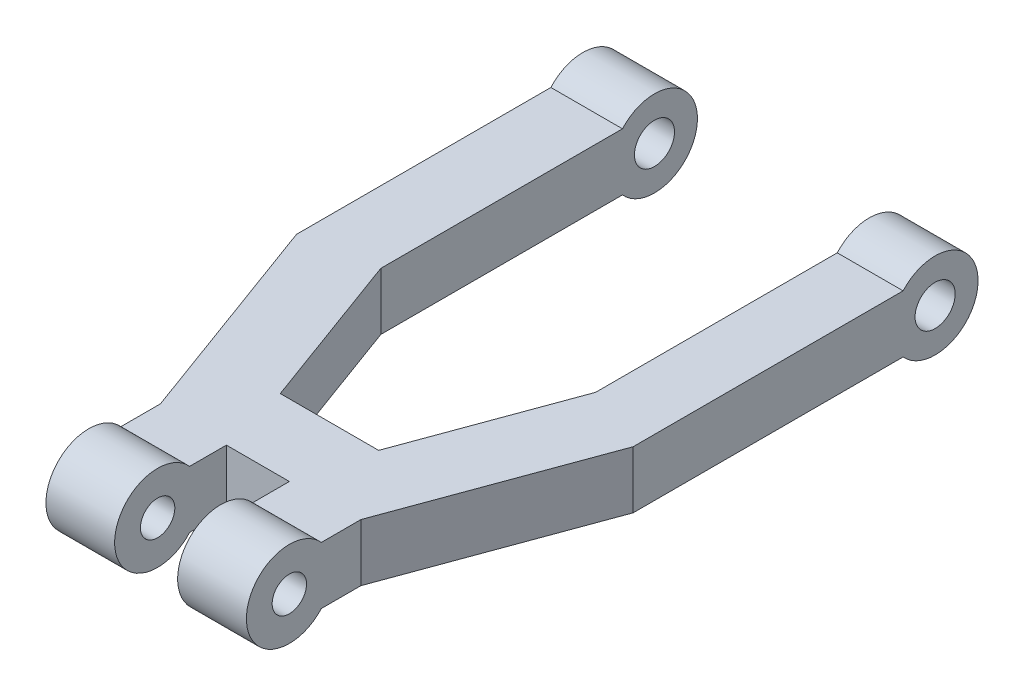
ISO-10303-21;
HEADER;
FILE_DESCRIPTION(('STEP AP214'),'2;1');
FILE_NAME('part.step','',(''),(''),'','','');
FILE_SCHEMA(('AUTOMOTIVE_DESIGN { 1 0 10303 214 1 1 1 1 }'));
ENDSEC;
DATA;
#1=APPLICATION_CONTEXT('core data for automotive mechanical design processes');
#2=APPLICATION_PROTOCOL_DEFINITION('international standard','automotive_design',2000,#1);
#3=PRODUCT_CONTEXT('',#1,'mechanical');
#4=PRODUCT('Part','Part','',(#3));
#5=PRODUCT_RELATED_PRODUCT_CATEGORY('part','',(#4));
#6=PRODUCT_DEFINITION_FORMATION('','',#4);
#7=PRODUCT_DEFINITION_CONTEXT('part definition',#1,'design');
#8=PRODUCT_DEFINITION('design','',#6,#7);
#9=PRODUCT_DEFINITION_SHAPE('','',#8);
#10=(LENGTH_UNIT() NAMED_UNIT(*) SI_UNIT(.MILLI.,.METRE.));
#11=(NAMED_UNIT(*) PLANE_ANGLE_UNIT() SI_UNIT($,.RADIAN.));
#12=(NAMED_UNIT(*) SI_UNIT($,.STERADIAN.) SOLID_ANGLE_UNIT());
#13=UNCERTAINTY_MEASURE_WITH_UNIT(LENGTH_MEASURE(1.E-05),#10,'distance_accuracy_value','');
#14=(GEOMETRIC_REPRESENTATION_CONTEXT(3) GLOBAL_UNCERTAINTY_ASSIGNED_CONTEXT((#13)) GLOBAL_UNIT_ASSIGNED_CONTEXT((#10,
#11,#12)) REPRESENTATION_CONTEXT('',''));
#15=CARTESIAN_POINT('',(0.,0.,0.));
#16=DIRECTION('',(0.,0.,1.));
#17=DIRECTION('',(1.,0.,0.));
#18=AXIS2_PLACEMENT_3D('',#15,#16,#17);
#19=CARTESIAN_POINT('',(0.,2.54,0.));
#20=DIRECTION('',(1.,0.,0.));
#21=DIRECTION('',(0.,0.,-1.));
#22=AXIS2_PLACEMENT_3D('',#19,#20,#21);
#23=CYLINDRICAL_SURFACE('',#22,3.81);
#24=CARTESIAN_POINT('',(13.081,2.54,0.));
#25=DIRECTION('',(-1.,0.,0.));
#26=DIRECTION('',(0.,0.,1.));
#27=AXIS2_PLACEMENT_3D('',#24,#25,#26);
#28=CIRCLE('',#27,3.81);
#29=CARTESIAN_POINT('',(13.081,5.08,-2.83980633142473));
#30=VERTEX_POINT('',#29);
#31=CARTESIAN_POINT('',(13.081,0.,-2.83980633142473));
#32=VERTEX_POINT('',#31);
#33=EDGE_CURVE('E272',#30,#32,#28,.F.);
#34=ORIENTED_EDGE('',*,*,#33,.F.);
#35=DIRECTION('',(1.,0.,0.));
#36=VECTOR('',#35,1.);
#37=CARTESIAN_POINT('',(0.,5.08,-2.83980633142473));
#38=LINE('',#37,#36);
#39=CARTESIAN_POINT('',(6.985,5.08,-2.83980633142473));
#40=VERTEX_POINT('',#39);
#41=EDGE_CURVE('E253',#40,#30,#38,.T.);
#42=ORIENTED_EDGE('',*,*,#41,.F.);
#43=CARTESIAN_POINT('',(6.985,2.54,0.));
#44=DIRECTION('',(1.,0.,0.));
#45=DIRECTION('',(0.,0.,-1.));
#46=AXIS2_PLACEMENT_3D('',#43,#44,#45);
#47=CIRCLE('',#46,3.81);
#48=CARTESIAN_POINT('',(6.985,0.,-2.83980633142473));
#49=VERTEX_POINT('',#48);
#50=EDGE_CURVE('E49',#49,#40,#47,.F.);
#51=ORIENTED_EDGE('',*,*,#50,.F.);
#52=DIRECTION('',(1.,0.,0.));
#53=VECTOR('',#52,1.);
#54=CARTESIAN_POINT('',(0.,0.,-2.83980633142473));
#55=LINE('',#54,#53);
#56=EDGE_CURVE('E254',#32,#49,#55,.F.);
#57=ORIENTED_EDGE('',*,*,#56,.F.);
#58=EDGE_LOOP('',(#34,#42,#51,#57));
#59=FACE_BOUND('',#58,.T.);
#60=ADVANCED_FACE('F32',(#59),#23,.T.);
#61=CARTESIAN_POINT('',(0.,2.54,-50.8));
#62=DIRECTION('',(1.,0.,0.));
#63=DIRECTION('',(0.,0.,-1.));
#64=AXIS2_PLACEMENT_3D('',#61,#62,#63);
#65=CYLINDRICAL_SURFACE('',#64,3.81);
#66=CARTESIAN_POINT('',(6.35,2.54,-50.8));
#67=DIRECTION('',(-1.,0.,0.));
#68=DIRECTION('',(0.,0.,1.));
#69=AXIS2_PLACEMENT_3D('',#66,#67,#68);
#70=CIRCLE('',#69,3.81);
#71=CARTESIAN_POINT('',(6.35,0.,-47.9601936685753));
#72=VERTEX_POINT('',#71);
#73=CARTESIAN_POINT('',(6.35,5.08,-47.9601936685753));
#74=VERTEX_POINT('',#73);
#75=EDGE_CURVE('E57',#72,#74,#70,.F.);
#76=ORIENTED_EDGE('',*,*,#75,.F.);
#77=DIRECTION('',(1.,0.,0.));
#78=VECTOR('',#77,1.);
#79=CARTESIAN_POINT('',(0.,0.,-47.9601936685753));
#80=LINE('',#79,#78);
#81=CARTESIAN_POINT('',(0.,0.,-47.9601936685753));
#82=VERTEX_POINT('',#81);
#83=EDGE_CURVE('E184',#82,#72,#80,.T.);
#84=ORIENTED_EDGE('',*,*,#83,.F.);
#85=CARTESIAN_POINT('',(0.,2.54,-50.8));
#86=DIRECTION('',(1.,0.,0.));
#87=DIRECTION('',(0.,0.,-1.));
#88=AXIS2_PLACEMENT_3D('',#85,#86,#87);
#89=CIRCLE('',#88,3.81);
#90=CARTESIAN_POINT('',(0.,5.08,-47.9601936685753));
#91=VERTEX_POINT('',#90);
#92=EDGE_CURVE('E240',#82,#91,#89,.T.);
#93=ORIENTED_EDGE('',*,*,#92,.T.);
#94=DIRECTION('',(1.,0.,0.));
#95=VECTOR('',#94,1.);
#96=CARTESIAN_POINT('',(0.,5.08,-47.9601936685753));
#97=LINE('',#96,#95);
#98=EDGE_CURVE('E243',#74,#91,#97,.F.);
#99=ORIENTED_EDGE('',*,*,#98,.F.);
#100=EDGE_LOOP('',(#76,#84,#93,#99));
#101=FACE_BOUND('',#100,.T.);
#102=ADVANCED_FACE('F371',(#101),#65,.T.);
#103=CARTESIAN_POINT('',(31.242,0.,0.));
#104=DIRECTION('',(0.,1.,0.));
#105=DIRECTION('',(0.,0.,1.));
#106=AXIS2_PLACEMENT_3D('',#103,#104,#105);
#107=PLANE('',#106);
#108=DIRECTION('',(-0.344254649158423,0.,0.938876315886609));
#109=VECTOR('',#108,1.);
#110=CARTESIAN_POINT('',(23.4801978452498,0.,-2.84599412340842));
#111=LINE('',#110,#109);
#112=CARTESIAN_POINT('',(31.242,0.,-24.0145454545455));
#113=VERTEX_POINT('',#112);
#114=CARTESIAN_POINT('',(24.765,0.,-6.35));
#115=VERTEX_POINT('',#114);
#116=EDGE_CURVE('E231',#113,#115,#111,.T.);
#117=ORIENTED_EDGE('',*,*,#116,.T.);
#118=DIRECTION('',(0.,0.,1.));
#119=VECTOR('',#118,1.);
#120=CARTESIAN_POINT('',(24.765,0.,0.));
#121=LINE('',#120,#119);
#122=CARTESIAN_POINT('',(24.765,0.,-2.83980633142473));
#123=VERTEX_POINT('',#122);
#124=EDGE_CURVE('E219',#115,#123,#121,.T.);
#125=ORIENTED_EDGE('',*,*,#124,.T.);
#126=CARTESIAN_POINT('',(18.669,0.,-2.83980633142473));
#127=VERTEX_POINT('',#126);
#128=EDGE_CURVE('E257',#123,#127,#55,.F.);
#129=ORIENTED_EDGE('',*,*,#128,.T.);
#130=DIRECTION('',(0.,0.,-1.));
#131=VECTOR('',#130,1.);
#132=CARTESIAN_POINT('',(18.669,0.,0.));
#133=LINE('',#132,#131);
#134=CARTESIAN_POINT('',(18.669,0.,-6.09943639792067));
#135=VERTEX_POINT('',#134);
#136=EDGE_CURVE('E210',#127,#135,#133,.T.);
#137=ORIENTED_EDGE('',*,*,#136,.T.);
#138=DIRECTION('',(-1.,0.,0.));
#139=VECTOR('',#138,1.);
#140=CARTESIAN_POINT('',(31.242,0.,-6.09943639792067));
#141=LINE('',#140,#139);
#142=CARTESIAN_POINT('',(13.081,0.,-6.09943639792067));
#143=VERTEX_POINT('',#142);
#144=EDGE_CURVE('E173',#135,#143,#141,.T.);
#145=ORIENTED_EDGE('',*,*,#144,.T.);
#146=DIRECTION('',(0.,0.,1.));
#147=VECTOR('',#146,1.);
#148=CARTESIAN_POINT('',(13.081,0.,0.));
#149=LINE('',#148,#147);
#150=EDGE_CURVE('E207',#143,#32,#149,.T.);
#151=ORIENTED_EDGE('',*,*,#150,.T.);
#152=ORIENTED_EDGE('',*,*,#56,.T.);
#153=DIRECTION('',(0.,0.,-1.));
#154=VECTOR('',#153,1.);
#155=CARTESIAN_POINT('',(6.985,0.,0.));
#156=LINE('',#155,#154);
#157=CARTESIAN_POINT('',(6.985,0.,-6.35));
#158=VERTEX_POINT('',#157);
#159=EDGE_CURVE('E198',#49,#158,#156,.T.);
#160=ORIENTED_EDGE('',*,*,#159,.T.);
#161=DIRECTION('',(-0.344254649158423,0.,-0.938876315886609));
#162=VECTOR('',#161,1.);
#163=CARTESIAN_POINT('',(11.9121273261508,0.,7.08761998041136));
#164=LINE('',#163,#162);
#165=CARTESIAN_POINT('',(0.,0.,-25.4));
#166=VERTEX_POINT('',#165);
#167=EDGE_CURVE('E225',#158,#166,#164,.T.);
#168=ORIENTED_EDGE('',*,*,#167,.T.);
#169=DIRECTION('',(0.,0.,-1.));
#170=VECTOR('',#169,1.);
#171=CARTESIAN_POINT('',(0.,0.,0.));
#172=LINE('',#171,#170);
#173=EDGE_CURVE('E264',#166,#82,#172,.T.);
#174=ORIENTED_EDGE('',*,*,#173,.T.);
#175=ORIENTED_EDGE('',*,*,#83,.T.);
#176=DIRECTION('',(0.,0.,1.));
#177=VECTOR('',#176,1.);
#178=CARTESIAN_POINT('',(6.35,0.,0.));
#179=LINE('',#178,#177);
#180=CARTESIAN_POINT('',(6.35,0.,-26.5274659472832));
#181=VERTEX_POINT('',#180);
#182=EDGE_CURVE('E177',#72,#181,#179,.T.);
#183=ORIENTED_EDGE('',*,*,#182,.T.);
#184=DIRECTION('',(0.344254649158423,0.,0.938876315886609));
#185=VECTOR('',#184,1.);
#186=CARTESIAN_POINT('',(17.8739919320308,0.,4.90160295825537));
#187=LINE('',#186,#185);
#188=CARTESIAN_POINT('',(11.5119441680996,0.,-12.4494363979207));
#189=VERTEX_POINT('',#188);
#190=EDGE_CURVE('E162',#181,#189,#187,.T.);
#191=ORIENTED_EDGE('',*,*,#190,.T.);
#192=DIRECTION('',(1.,0.,0.));
#193=VECTOR('',#192,1.);
#194=CARTESIAN_POINT('',(31.242,0.,-12.4494363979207));
#195=LINE('',#194,#193);
#196=CARTESIAN_POINT('',(20.2380558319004,0.,-12.4494363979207));
#197=VERTEX_POINT('',#196);
#198=EDGE_CURVE('E172',#189,#197,#195,.T.);
#199=ORIENTED_EDGE('',*,*,#198,.T.);
#200=DIRECTION('',(0.344254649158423,0.,-0.938876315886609));
#201=VECTOR('',#200,1.);
#202=CARTESIAN_POINT('',(17.5183332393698,0.,-5.0320111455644));
#203=LINE('',#202,#201);
#204=CARTESIAN_POINT('',(25.4,0.,-26.5274659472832));
#205=VERTEX_POINT('',#204);
#206=EDGE_CURVE('E236',#197,#205,#203,.T.);
#207=ORIENTED_EDGE('',*,*,#206,.T.);
#208=DIRECTION('',(0.,0.,-1.));
#209=VECTOR('',#208,1.);
#210=CARTESIAN_POINT('',(25.4,0.,0.));
#211=LINE('',#210,#209);
#212=CARTESIAN_POINT('',(25.4,0.,-47.9601936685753));
#213=VERTEX_POINT('',#212);
#214=EDGE_CURVE('E195',#205,#213,#211,.T.);
#215=ORIENTED_EDGE('',*,*,#214,.T.);
#216=CARTESIAN_POINT('',(31.242,0.,-47.9601936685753));
#217=VERTEX_POINT('',#216);
#218=EDGE_CURVE('E248',#213,#217,#80,.T.);
#219=ORIENTED_EDGE('',*,*,#218,.T.);
#220=DIRECTION('',(0.,0.,-1.));
#221=VECTOR('',#220,1.);
#222=CARTESIAN_POINT('',(31.242,0.,0.));
#223=LINE('',#222,#221);
#224=EDGE_CURVE('E258',#113,#217,#223,.T.);
#225=ORIENTED_EDGE('',*,*,#224,.F.);
#226=EDGE_LOOP('',(#117,#125,#129,#137,#145,#151,#152,#160,#168,#174,#175,#183,#191,#199,#207,
#215,#219,#225));
#227=FACE_BOUND('',#226,.T.);
#228=ADVANCED_FACE('F34',(#227),#107,.F.);
#229=CARTESIAN_POINT('',(31.242,5.08,0.));
#230=DIRECTION('',(0.,-1.,0.));
#231=DIRECTION('',(0.,0.,-1.));
#232=AXIS2_PLACEMENT_3D('',#229,#230,#231);
#233=PLANE('',#232);
#234=CARTESIAN_POINT('',(18.669,5.08,-2.83980633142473));
#235=VERTEX_POINT('',#234);
#236=CARTESIAN_POINT('',(24.765,5.08,-2.83980633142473));
#237=VERTEX_POINT('',#236);
#238=EDGE_CURVE('E250',#235,#237,#38,.T.);
#239=ORIENTED_EDGE('',*,*,#238,.T.);
#240=DIRECTION('',(0.,0.,-1.));
#241=VECTOR('',#240,1.);
#242=CARTESIAN_POINT('',(24.765,5.08,0.));
#243=LINE('',#242,#241);
#244=CARTESIAN_POINT('',(24.765,5.08,-6.35));
#245=VERTEX_POINT('',#244);
#246=EDGE_CURVE('E216',#237,#245,#243,.T.);
#247=ORIENTED_EDGE('',*,*,#246,.T.);
#248=DIRECTION('',(0.344254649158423,0.,-0.938876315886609));
#249=VECTOR('',#248,1.);
#250=CARTESIAN_POINT('',(23.4801978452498,5.08,-2.84599412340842));
#251=LINE('',#250,#249);
#252=CARTESIAN_POINT('',(31.242,5.08,-24.0145454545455));
#253=VERTEX_POINT('',#252);
#254=EDGE_CURVE('E228',#245,#253,#251,.T.);
#255=ORIENTED_EDGE('',*,*,#254,.T.);
#256=DIRECTION('',(0.,0.,1.));
#257=VECTOR('',#256,1.);
#258=CARTESIAN_POINT('',(31.242,5.08,0.));
#259=LINE('',#258,#257);
#260=CARTESIAN_POINT('',(31.242,5.08,-47.9601936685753));
#261=VERTEX_POINT('',#260);
#262=EDGE_CURVE('E260',#261,#253,#259,.T.);
#263=ORIENTED_EDGE('',*,*,#262,.F.);
#264=CARTESIAN_POINT('',(25.4,5.08,-47.9601936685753));
#265=VERTEX_POINT('',#264);
#266=EDGE_CURVE('E245',#261,#265,#97,.F.);
#267=ORIENTED_EDGE('',*,*,#266,.T.);
#268=DIRECTION('',(0.,0.,1.));
#269=VECTOR('',#268,1.);
#270=CARTESIAN_POINT('',(25.4,5.08,0.));
#271=LINE('',#270,#269);
#272=CARTESIAN_POINT('',(25.4,5.08,-26.5274659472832));
#273=VERTEX_POINT('',#272);
#274=EDGE_CURVE('E187',#265,#273,#271,.T.);
#275=ORIENTED_EDGE('',*,*,#274,.T.);
#276=DIRECTION('',(-0.344254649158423,0.,0.938876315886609));
#277=VECTOR('',#276,1.);
#278=CARTESIAN_POINT('',(17.5183332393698,5.08,-5.0320111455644));
#279=LINE('',#278,#277);
#280=CARTESIAN_POINT('',(20.2380558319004,5.08,-12.4494363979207));
#281=VERTEX_POINT('',#280);
#282=EDGE_CURVE('E11',#273,#281,#279,.T.);
#283=ORIENTED_EDGE('',*,*,#282,.T.);
#284=DIRECTION('',(-1.,0.,0.));
#285=VECTOR('',#284,1.);
#286=CARTESIAN_POINT('',(31.242,5.08,-12.4494363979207));
#287=LINE('',#286,#285);
#288=CARTESIAN_POINT('',(11.5119441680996,5.08,-12.4494363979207));
#289=VERTEX_POINT('',#288);
#290=EDGE_CURVE('E41',#281,#289,#287,.T.);
#291=ORIENTED_EDGE('',*,*,#290,.T.);
#292=DIRECTION('',(-0.344254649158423,0.,-0.938876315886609));
#293=VECTOR('',#292,1.);
#294=CARTESIAN_POINT('',(17.8739919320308,5.08,4.90160295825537));
#295=LINE('',#294,#293);
#296=CARTESIAN_POINT('',(6.35,5.08,-26.5274659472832));
#297=VERTEX_POINT('',#296);
#298=EDGE_CURVE('E286',#289,#297,#295,.T.);
#299=ORIENTED_EDGE('',*,*,#298,.T.);
#300=DIRECTION('',(0.,0.,-1.));
#301=VECTOR('',#300,1.);
#302=CARTESIAN_POINT('',(6.35,5.08,0.));
#303=LINE('',#302,#301);
#304=EDGE_CURVE('E180',#297,#74,#303,.T.);
#305=ORIENTED_EDGE('',*,*,#304,.T.);
#306=ORIENTED_EDGE('',*,*,#98,.T.);
#307=DIRECTION('',(0.,0.,1.));
#308=VECTOR('',#307,1.);
#309=CARTESIAN_POINT('',(0.,5.08,0.));
#310=LINE('',#309,#308);
#311=CARTESIAN_POINT('',(0.,5.08,-25.4));
#312=VERTEX_POINT('',#311);
#313=EDGE_CURVE('E261',#91,#312,#310,.T.);
#314=ORIENTED_EDGE('',*,*,#313,.T.);
#315=DIRECTION('',(0.344254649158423,0.,0.938876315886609));
#316=VECTOR('',#315,1.);
#317=CARTESIAN_POINT('',(11.9121273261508,5.08,7.08761998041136));
#318=LINE('',#317,#316);
#319=CARTESIAN_POINT('',(6.985,5.08,-6.35));
#320=VERTEX_POINT('',#319);
#321=EDGE_CURVE('E222',#312,#320,#318,.T.);
#322=ORIENTED_EDGE('',*,*,#321,.T.);
#323=DIRECTION('',(0.,0.,1.));
#324=VECTOR('',#323,1.);
#325=CARTESIAN_POINT('',(6.985,5.08,0.));
#326=LINE('',#325,#324);
#327=EDGE_CURVE('E201',#320,#40,#326,.T.);
#328=ORIENTED_EDGE('',*,*,#327,.T.);
#329=ORIENTED_EDGE('',*,*,#41,.T.);
#330=DIRECTION('',(0.,0.,-1.));
#331=VECTOR('',#330,1.);
#332=CARTESIAN_POINT('',(13.081,5.08,0.));
#333=LINE('',#332,#331);
#334=CARTESIAN_POINT('',(13.081,5.08,-6.09943639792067));
#335=VERTEX_POINT('',#334);
#336=EDGE_CURVE('E204',#30,#335,#333,.T.);
#337=ORIENTED_EDGE('',*,*,#336,.T.);
#338=DIRECTION('',(1.,0.,0.));
#339=VECTOR('',#338,1.);
#340=CARTESIAN_POINT('',(31.242,5.08,-6.09943639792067));
#341=LINE('',#340,#339);
#342=CARTESIAN_POINT('',(18.669,5.08,-6.09943639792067));
#343=VERTEX_POINT('',#342);
#344=EDGE_CURVE('E283',#335,#343,#341,.T.);
#345=ORIENTED_EDGE('',*,*,#344,.T.);
#346=DIRECTION('',(0.,0.,1.));
#347=VECTOR('',#346,1.);
#348=CARTESIAN_POINT('',(18.669,5.08,0.));
#349=LINE('',#348,#347);
#350=EDGE_CURVE('E213',#343,#235,#349,.T.);
#351=ORIENTED_EDGE('',*,*,#350,.T.);
#352=EDGE_LOOP('',(#239,#247,#255,#263,#267,#275,#283,#291,#299,#305,#306,#314,#322,#328,#329,
#337,#345,#351));
#353=FACE_BOUND('',#352,.T.);
#354=ADVANCED_FACE('F331',(#353),#233,.F.);
#355=CARTESIAN_POINT('',(31.242,0.,0.));
#356=DIRECTION('',(-1.,0.,0.));
#357=DIRECTION('',(0.,0.,1.));
#358=AXIS2_PLACEMENT_3D('',#355,#356,#357);
#359=PLANE('',#358);
#360=CARTESIAN_POINT('',(31.242,2.54,-50.8));
#361=DIRECTION('',(-1.,0.,0.));
#362=DIRECTION('',(0.,0.,1.));
#363=AXIS2_PLACEMENT_3D('',#360,#361,#362);
#364=CIRCLE('',#363,1.778);
#365=CARTESIAN_POINT('',(31.242,2.54,-49.022));
#366=VERTEX_POINT('',#365);
#367=EDGE_CURVE('E292',#366,#366,#364,.T.);
#368=ORIENTED_EDGE('',*,*,#367,.T.);
#369=EDGE_LOOP('',(#368));
#370=FACE_BOUND('',#369,.T.);
#371=ORIENTED_EDGE('',*,*,#262,.T.);
#372=DIRECTION('',(0.,-1.,0.));
#373=VECTOR('',#372,1.);
#374=CARTESIAN_POINT('',(31.242,0.,-24.0145454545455));
#375=LINE('',#374,#373);
#376=EDGE_CURVE('E280',#253,#113,#375,.T.);
#377=ORIENTED_EDGE('',*,*,#376,.T.);
#378=ORIENTED_EDGE('',*,*,#224,.T.);
#379=CARTESIAN_POINT('',(31.242,2.54,-50.8));
#380=DIRECTION('',(1.,0.,0.));
#381=DIRECTION('',(0.,0.,-1.));
#382=AXIS2_PLACEMENT_3D('',#379,#380,#381);
#383=CIRCLE('',#382,3.81);
#384=EDGE_CURVE('E239',#217,#261,#383,.T.);
#385=ORIENTED_EDGE('',*,*,#384,.T.);
#386=EDGE_LOOP('',(#371,#377,#378,#385));
#387=FACE_BOUND('',#386,.T.);
#388=ADVANCED_FACE('F347',(#370,#387),#359,.F.);
#389=CARTESIAN_POINT('',(0.,0.,0.));
#390=DIRECTION('',(-1.,0.,0.));
#391=DIRECTION('',(0.,0.,1.));
#392=AXIS2_PLACEMENT_3D('',#389,#390,#391);
#393=PLANE('',#392);
#394=CARTESIAN_POINT('',(0.,2.54,-50.8));
#395=DIRECTION('',(-1.,0.,0.));
#396=DIRECTION('',(0.,0.,1.));
#397=AXIS2_PLACEMENT_3D('',#394,#395,#396);
#398=CIRCLE('',#397,1.778);
#399=CARTESIAN_POINT('',(0.,2.54,-49.022));
#400=VERTEX_POINT('',#399);
#401=EDGE_CURVE('E299',#400,#400,#398,.T.);
#402=ORIENTED_EDGE('',*,*,#401,.F.);
#403=EDGE_LOOP('',(#402));
#404=FACE_BOUND('',#403,.T.);
#405=DIRECTION('',(0.,-1.,0.));
#406=VECTOR('',#405,1.);
#407=CARTESIAN_POINT('',(0.,0.,-25.4));
#408=LINE('',#407,#406);
#409=EDGE_CURVE('E278',#312,#166,#408,.T.);
#410=ORIENTED_EDGE('',*,*,#409,.F.);
#411=ORIENTED_EDGE('',*,*,#313,.F.);
#412=ORIENTED_EDGE('',*,*,#92,.F.);
#413=ORIENTED_EDGE('',*,*,#173,.F.);
#414=EDGE_LOOP('',(#410,#411,#412,#413));
#415=FACE_BOUND('',#414,.T.);
#416=ADVANCED_FACE('F379',(#404,#415),#393,.T.);
#417=CARTESIAN_POINT('',(24.765,2.54,0.));
#418=DIRECTION('',(-1.,0.,0.));
#419=DIRECTION('',(0.,0.,1.));
#420=AXIS2_PLACEMENT_3D('',#417,#418,#419);
#421=CIRCLE('',#420,3.81);
#422=EDGE_CURVE('E276',#237,#123,#421,.F.);
#423=ORIENTED_EDGE('',*,*,#422,.F.);
#424=ORIENTED_EDGE('',*,*,#238,.F.);
#425=CARTESIAN_POINT('',(18.669,2.54,0.));
#426=DIRECTION('',(1.,0.,0.));
#427=DIRECTION('',(0.,0.,-1.));
#428=AXIS2_PLACEMENT_3D('',#425,#426,#427);
#429=CIRCLE('',#428,3.81);
#430=EDGE_CURVE('E274',#127,#235,#429,.F.);
#431=ORIENTED_EDGE('',*,*,#430,.F.);
#432=ORIENTED_EDGE('',*,*,#128,.F.);
#433=EDGE_LOOP('',(#423,#424,#431,#432));
#434=FACE_BOUND('',#433,.T.);
#435=ADVANCED_FACE('F358',(#434),#23,.T.);
#436=CARTESIAN_POINT('',(25.4,2.54,-50.8));
#437=DIRECTION('',(1.,0.,0.));
#438=DIRECTION('',(0.,0.,-1.));
#439=AXIS2_PLACEMENT_3D('',#436,#437,#438);
#440=CIRCLE('',#439,3.81);
#441=EDGE_CURVE('E269',#265,#213,#440,.F.);
#442=ORIENTED_EDGE('',*,*,#441,.F.);
#443=ORIENTED_EDGE('',*,*,#266,.F.);
#444=ORIENTED_EDGE('',*,*,#384,.F.);
#445=ORIENTED_EDGE('',*,*,#218,.F.);
#446=EDGE_LOOP('',(#442,#443,#444,#445));
#447=FACE_BOUND('',#446,.T.);
#448=ADVANCED_FACE('F343',(#447),#65,.T.);
#449=CARTESIAN_POINT('',(25.4,-1.27,-26.5274659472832));
#450=DIRECTION('',(0.938876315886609,0.,0.344254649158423));
#451=DIRECTION('',(0.344254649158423,0.,-0.938876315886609));
#452=AXIS2_PLACEMENT_3D('',#449,#450,#451);
#453=PLANE('',#452);
#454=DIRECTION('',(0.,1.,0.));
#455=VECTOR('',#454,1.);
#456=CARTESIAN_POINT('',(20.2380558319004,-1.27,-12.4494363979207));
#457=LINE('',#456,#455);
#458=EDGE_CURVE('E324',#197,#281,#457,.T.);
#459=ORIENTED_EDGE('',*,*,#458,.T.);
#460=ORIENTED_EDGE('',*,*,#282,.F.);
#461=DIRECTION('',(0.,1.,0.));
#462=VECTOR('',#461,1.);
#463=CARTESIAN_POINT('',(25.4,-1.27,-26.5274659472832));
#464=LINE('',#463,#462);
#465=EDGE_CURVE('E190',#205,#273,#464,.T.);
#466=ORIENTED_EDGE('',*,*,#465,.F.);
#467=ORIENTED_EDGE('',*,*,#206,.F.);
#468=EDGE_LOOP('',(#459,#460,#466,#467));
#469=FACE_BOUND('',#468,.T.);
#470=ADVANCED_FACE('F335',(#469),#453,.F.);
#471=CARTESIAN_POINT('',(11.5119441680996,-1.27,-12.4494363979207));
#472=DIRECTION('',(0.,0.,1.));
#473=DIRECTION('',(1.,0.,0.));
#474=AXIS2_PLACEMENT_3D('',#471,#472,#473);
#475=PLANE('',#474);
#476=DIRECTION('',(0.,1.,0.));
#477=VECTOR('',#476,1.);
#478=CARTESIAN_POINT('',(11.5119441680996,-1.27,-12.4494363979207));
#479=LINE('',#478,#477);
#480=EDGE_CURVE('E168',#189,#289,#479,.T.);
#481=ORIENTED_EDGE('',*,*,#480,.T.);
#482=ORIENTED_EDGE('',*,*,#290,.F.);
#483=ORIENTED_EDGE('',*,*,#458,.F.);
#484=ORIENTED_EDGE('',*,*,#198,.F.);
#485=EDGE_LOOP('',(#481,#482,#483,#484));
#486=FACE_BOUND('',#485,.T.);
#487=ADVANCED_FACE('F328',(#486),#475,.F.);
#488=CARTESIAN_POINT('',(6.35,-1.27,-26.5274659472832));
#489=DIRECTION('',(-0.938876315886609,0.,0.344254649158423));
#490=DIRECTION('',(0.344254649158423,0.,0.938876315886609));
#491=AXIS2_PLACEMENT_3D('',#488,#489,#490);
#492=PLANE('',#491);
#493=DIRECTION('',(0.,1.,0.));
#494=VECTOR('',#493,1.);
#495=CARTESIAN_POINT('',(6.35,-1.27,-26.5274659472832));
#496=LINE('',#495,#494);
#497=EDGE_CURVE('E165',#181,#297,#496,.T.);
#498=ORIENTED_EDGE('',*,*,#497,.T.);
#499=ORIENTED_EDGE('',*,*,#298,.F.);
#500=ORIENTED_EDGE('',*,*,#480,.F.);
#501=ORIENTED_EDGE('',*,*,#190,.F.);
#502=EDGE_LOOP('',(#498,#499,#500,#501));
#503=FACE_BOUND('',#502,.T.);
#504=ADVANCED_FACE('F164',(#503),#492,.F.);
#505=CARTESIAN_POINT('',(25.4,-1.27,-57.9100704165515));
#506=DIRECTION('',(1.,0.,0.));
#507=DIRECTION('',(0.,0.,-1.));
#508=AXIS2_PLACEMENT_3D('',#505,#506,#507);
#509=PLANE('',#508);
#510=CARTESIAN_POINT('',(25.4,2.54,-50.8));
#511=DIRECTION('',(1.,0.,0.));
#512=DIRECTION('',(0.,0.,-1.));
#513=AXIS2_PLACEMENT_3D('',#510,#511,#512);
#514=CIRCLE('',#513,1.778);
#515=CARTESIAN_POINT('',(25.4,2.54,-49.022));
#516=VERTEX_POINT('',#515);
#517=EDGE_CURVE('E311',#516,#516,#514,.T.);
#518=ORIENTED_EDGE('',*,*,#517,.T.);
#519=EDGE_LOOP('',(#518));
#520=FACE_BOUND('',#519,.T.);
#521=ORIENTED_EDGE('',*,*,#465,.T.);
#522=ORIENTED_EDGE('',*,*,#274,.F.);
#523=ORIENTED_EDGE('',*,*,#441,.T.);
#524=ORIENTED_EDGE('',*,*,#214,.F.);
#525=EDGE_LOOP('',(#521,#522,#523,#524));
#526=FACE_BOUND('',#525,.T.);
#527=ADVANCED_FACE('F337',(#520,#526),#509,.F.);
#528=CARTESIAN_POINT('',(6.35,-1.27,-57.9100704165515));
#529=DIRECTION('',(-1.,0.,0.));
#530=DIRECTION('',(0.,0.,1.));
#531=AXIS2_PLACEMENT_3D('',#528,#529,#530);
#532=PLANE('',#531);
#533=CARTESIAN_POINT('',(6.35,2.54,-50.8));
#534=DIRECTION('',(-1.,0.,0.));
#535=DIRECTION('',(0.,0.,1.));
#536=AXIS2_PLACEMENT_3D('',#533,#534,#535);
#537=CIRCLE('',#536,1.778);
#538=CARTESIAN_POINT('',(6.35,2.54,-49.022));
#539=VERTEX_POINT('',#538);
#540=EDGE_CURVE('E36',#539,#539,#537,.T.);
#541=ORIENTED_EDGE('',*,*,#540,.T.);
#542=EDGE_LOOP('',(#541));
#543=FACE_BOUND('',#542,.T.);
#544=ORIENTED_EDGE('',*,*,#497,.F.);
#545=ORIENTED_EDGE('',*,*,#182,.F.);
#546=ORIENTED_EDGE('',*,*,#75,.T.);
#547=ORIENTED_EDGE('',*,*,#304,.F.);
#548=EDGE_LOOP('',(#544,#545,#546,#547));
#549=FACE_BOUND('',#548,.T.);
#550=ADVANCED_FACE('F176',(#543,#549),#532,.F.);
#551=CARTESIAN_POINT('',(0.,-1.27,-25.4));
#552=DIRECTION('',(0.938876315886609,0.,-0.344254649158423));
#553=DIRECTION('',(-0.344254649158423,0.,-0.938876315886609));
#554=AXIS2_PLACEMENT_3D('',#551,#552,#553);
#555=PLANE('',#554);
#556=DIRECTION('',(0.,1.,0.));
#557=VECTOR('',#556,1.);
#558=CARTESIAN_POINT('',(6.985,-1.27,-6.35));
#559=LINE('',#558,#557);
#560=EDGE_CURVE('E185',#158,#320,#559,.T.);
#561=ORIENTED_EDGE('',*,*,#560,.T.);
#562=ORIENTED_EDGE('',*,*,#321,.F.);
#563=ORIENTED_EDGE('',*,*,#409,.T.);
#564=ORIENTED_EDGE('',*,*,#167,.F.);
#565=EDGE_LOOP('',(#561,#562,#563,#564));
#566=FACE_BOUND('',#565,.T.);
#567=ADVANCED_FACE('F447',(#566),#555,.F.);
#568=CARTESIAN_POINT('',(6.985,-1.27,-6.35));
#569=DIRECTION('',(1.,0.,0.));
#570=DIRECTION('',(0.,0.,-1.));
#571=AXIS2_PLACEMENT_3D('',#568,#569,#570);
#572=PLANE('',#571);
#573=CARTESIAN_POINT('',(6.985,2.54,0.));
#574=DIRECTION('',(1.,0.,0.));
#575=DIRECTION('',(0.,0.,-1.));
#576=AXIS2_PLACEMENT_3D('',#573,#574,#575);
#577=CIRCLE('',#576,1.524);
#578=CARTESIAN_POINT('',(6.985,2.54,1.524));
#579=VERTEX_POINT('',#578);
#580=EDGE_CURVE('E308',#579,#579,#577,.T.);
#581=ORIENTED_EDGE('',*,*,#580,.T.);
#582=EDGE_LOOP('',(#581));
#583=FACE_BOUND('',#582,.T.);
#584=ORIENTED_EDGE('',*,*,#560,.F.);
#585=ORIENTED_EDGE('',*,*,#159,.F.);
#586=ORIENTED_EDGE('',*,*,#50,.T.);
#587=ORIENTED_EDGE('',*,*,#327,.F.);
#588=EDGE_LOOP('',(#584,#585,#586,#587));
#589=FACE_BOUND('',#588,.T.);
#590=ADVANCED_FACE('F456',(#583,#589),#572,.F.);
#591=CARTESIAN_POINT('',(13.081,-1.27,-6.09943639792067));
#592=DIRECTION('',(0.,0.,-1.));
#593=DIRECTION('',(-1.,0.,0.));
#594=AXIS2_PLACEMENT_3D('',#591,#592,#593);
#595=PLANE('',#594);
#596=DIRECTION('',(0.,1.,0.));
#597=VECTOR('',#596,1.);
#598=CARTESIAN_POINT('',(18.669,-1.27,-6.09943639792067));
#599=LINE('',#598,#597);
#600=EDGE_CURVE('E314',#135,#343,#599,.T.);
#601=ORIENTED_EDGE('',*,*,#600,.T.);
#602=ORIENTED_EDGE('',*,*,#344,.F.);
#603=DIRECTION('',(0.,1.,0.));
#604=VECTOR('',#603,1.);
#605=CARTESIAN_POINT('',(13.081,-1.27,-6.09943639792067));
#606=LINE('',#605,#604);
#607=EDGE_CURVE('E315',#143,#335,#606,.T.);
#608=ORIENTED_EDGE('',*,*,#607,.F.);
#609=ORIENTED_EDGE('',*,*,#144,.F.);
#610=EDGE_LOOP('',(#601,#602,#608,#609));
#611=FACE_BOUND('',#610,.T.);
#612=ADVANCED_FACE('F364',(#611),#595,.F.);
#613=CARTESIAN_POINT('',(18.669,-1.27,-6.09943639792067));
#614=DIRECTION('',(1.,0.,0.));
#615=DIRECTION('',(0.,0.,-1.));
#616=AXIS2_PLACEMENT_3D('',#613,#614,#615);
#617=PLANE('',#616);
#618=CARTESIAN_POINT('',(18.669,2.54,0.));
#619=DIRECTION('',(1.,0.,0.));
#620=DIRECTION('',(0.,0.,-1.));
#621=AXIS2_PLACEMENT_3D('',#618,#619,#620);
#622=CIRCLE('',#621,1.524);
#623=CARTESIAN_POINT('',(18.669,2.54,1.524));
#624=VERTEX_POINT('',#623);
#625=EDGE_CURVE('E296',#624,#624,#622,.T.);
#626=ORIENTED_EDGE('',*,*,#625,.T.);
#627=EDGE_LOOP('',(#626));
#628=FACE_BOUND('',#627,.T.);
#629=ORIENTED_EDGE('',*,*,#600,.F.);
#630=ORIENTED_EDGE('',*,*,#136,.F.);
#631=ORIENTED_EDGE('',*,*,#430,.T.);
#632=ORIENTED_EDGE('',*,*,#350,.F.);
#633=EDGE_LOOP('',(#629,#630,#631,#632));
#634=FACE_BOUND('',#633,.T.);
#635=ADVANCED_FACE('F362',(#628,#634),#617,.F.);
#636=CARTESIAN_POINT('',(13.081,-1.27,-6.09943639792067));
#637=DIRECTION('',(-1.,0.,0.));
#638=DIRECTION('',(0.,0.,1.));
#639=AXIS2_PLACEMENT_3D('',#636,#637,#638);
#640=PLANE('',#639);
#641=CARTESIAN_POINT('',(13.081,2.54,0.));
#642=DIRECTION('',(-1.,0.,0.));
#643=DIRECTION('',(0.,0.,1.));
#644=AXIS2_PLACEMENT_3D('',#641,#642,#643);
#645=CIRCLE('',#644,1.524);
#646=CARTESIAN_POINT('',(13.081,2.54,1.524));
#647=VERTEX_POINT('',#646);
#648=EDGE_CURVE('E291',#647,#647,#645,.T.);
#649=ORIENTED_EDGE('',*,*,#648,.T.);
#650=EDGE_LOOP('',(#649));
#651=FACE_BOUND('',#650,.T.);
#652=ORIENTED_EDGE('',*,*,#607,.T.);
#653=ORIENTED_EDGE('',*,*,#336,.F.);
#654=ORIENTED_EDGE('',*,*,#33,.T.);
#655=ORIENTED_EDGE('',*,*,#150,.F.);
#656=EDGE_LOOP('',(#652,#653,#654,#655));
#657=FACE_BOUND('',#656,.T.);
#658=ADVANCED_FACE('F369',(#651,#657),#640,.F.);
#659=CARTESIAN_POINT('',(31.75,-1.27,-25.4));
#660=DIRECTION('',(-0.938876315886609,0.,-0.344254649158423));
#661=DIRECTION('',(-0.344254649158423,0.,0.938876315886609));
#662=AXIS2_PLACEMENT_3D('',#659,#660,#661);
#663=PLANE('',#662);
#664=ORIENTED_EDGE('',*,*,#376,.F.);
#665=ORIENTED_EDGE('',*,*,#254,.F.);
#666=DIRECTION('',(0.,1.,0.));
#667=VECTOR('',#666,1.);
#668=CARTESIAN_POINT('',(24.765,-1.27,-6.35));
#669=LINE('',#668,#667);
#670=EDGE_CURVE('E181',#115,#245,#669,.T.);
#671=ORIENTED_EDGE('',*,*,#670,.F.);
#672=ORIENTED_EDGE('',*,*,#116,.F.);
#673=EDGE_LOOP('',(#664,#665,#671,#672));
#674=FACE_BOUND('',#673,.T.);
#675=ADVANCED_FACE('F352',(#674),#663,.F.);
#676=CARTESIAN_POINT('',(24.765,-1.27,-6.35));
#677=DIRECTION('',(-1.,0.,0.));
#678=DIRECTION('',(0.,0.,1.));
#679=AXIS2_PLACEMENT_3D('',#676,#677,#678);
#680=PLANE('',#679);
#681=CARTESIAN_POINT('',(24.765,2.54,0.));
#682=DIRECTION('',(-1.,0.,0.));
#683=DIRECTION('',(0.,0.,1.));
#684=AXIS2_PLACEMENT_3D('',#681,#682,#683);
#685=CIRCLE('',#684,1.524);
#686=CARTESIAN_POINT('',(24.765,2.54,1.524));
#687=VERTEX_POINT('',#686);
#688=EDGE_CURVE('E289',#687,#687,#685,.T.);
#689=ORIENTED_EDGE('',*,*,#688,.T.);
#690=EDGE_LOOP('',(#689));
#691=FACE_BOUND('',#690,.T.);
#692=ORIENTED_EDGE('',*,*,#670,.T.);
#693=ORIENTED_EDGE('',*,*,#246,.F.);
#694=ORIENTED_EDGE('',*,*,#422,.T.);
#695=ORIENTED_EDGE('',*,*,#124,.F.);
#696=EDGE_LOOP('',(#692,#693,#694,#695));
#697=FACE_BOUND('',#696,.T.);
#698=ADVANCED_FACE('F355',(#691,#697),#680,.F.);
#699=CARTESIAN_POINT('',(31.242,2.54,0.));
#700=DIRECTION('',(-1.,0.,0.));
#701=DIRECTION('',(0.,0.,1.));
#702=AXIS2_PLACEMENT_3D('',#699,#700,#701);
#703=CYLINDRICAL_SURFACE('',#702,1.524);
#704=CARTESIAN_POINT('',(24.765,2.54,1.524));
#705=CARTESIAN_POINT('',(24.7015,2.54,1.524));
#706=CARTESIAN_POINT('',(24.638,2.54,1.524));
#707=CARTESIAN_POINT('',(24.511,2.54,1.524));
#708=CARTESIAN_POINT('',(24.4475,2.54,1.524));
#709=CARTESIAN_POINT('',(24.3205,2.54,1.524));
#710=CARTESIAN_POINT('',(24.257,2.54,1.524));
#711=CARTESIAN_POINT('',(24.13,2.54,1.524));
#712=CARTESIAN_POINT('',(24.0665,2.54,1.524));
#713=CARTESIAN_POINT('',(23.9395,2.54,1.524));
#714=CARTESIAN_POINT('',(23.876,2.54,1.524));
#715=CARTESIAN_POINT('',(23.749,2.54,1.524));
#716=CARTESIAN_POINT('',(23.6855,2.54,1.524));
#717=CARTESIAN_POINT('',(23.5585,2.54,1.524));
#718=CARTESIAN_POINT('',(23.495,2.54,1.524));
#719=CARTESIAN_POINT('',(23.368,2.54,1.524));
#720=CARTESIAN_POINT('',(23.3045,2.54,1.524));
#721=CARTESIAN_POINT('',(23.1775,2.54,1.524));
#722=CARTESIAN_POINT('',(23.114,2.54,1.524));
#723=CARTESIAN_POINT('',(22.987,2.54,1.524));
#724=CARTESIAN_POINT('',(22.9235,2.54,1.524));
#725=CARTESIAN_POINT('',(22.7965,2.54,1.524));
#726=CARTESIAN_POINT('',(22.733,2.54,1.524));
#727=CARTESIAN_POINT('',(22.606,2.54,1.524));
#728=CARTESIAN_POINT('',(22.5425,2.54,1.524));
#729=CARTESIAN_POINT('',(22.4155,2.54,1.524));
#730=CARTESIAN_POINT('',(22.352,2.54,1.524));
#731=CARTESIAN_POINT('',(22.225,2.54,1.524));
#732=CARTESIAN_POINT('',(22.1615,2.54,1.524));
#733=CARTESIAN_POINT('',(22.0345,2.54,1.524));
#734=CARTESIAN_POINT('',(21.971,2.54,1.524));
#735=CARTESIAN_POINT('',(21.844,2.54,1.524));
#736=CARTESIAN_POINT('',(21.7805,2.54,1.524));
#737=CARTESIAN_POINT('',(21.6535,2.54,1.524));
#738=CARTESIAN_POINT('',(21.59,2.54,1.524));
#739=CARTESIAN_POINT('',(21.463,2.54,1.524));
#740=CARTESIAN_POINT('',(21.3995,2.54,1.524));
#741=CARTESIAN_POINT('',(21.2725,2.54,1.524));
#742=CARTESIAN_POINT('',(21.209,2.54,1.524));
#743=CARTESIAN_POINT('',(21.082,2.54,1.524));
#744=CARTESIAN_POINT('',(21.0185,2.54,1.524));
#745=CARTESIAN_POINT('',(20.8915,2.54,1.524));
#746=CARTESIAN_POINT('',(20.828,2.54,1.524));
#747=CARTESIAN_POINT('',(20.701,2.54,1.524));
#748=CARTESIAN_POINT('',(20.6375,2.54,1.524));
#749=CARTESIAN_POINT('',(20.5105,2.54,1.524));
#750=CARTESIAN_POINT('',(20.447,2.54,1.524));
#751=CARTESIAN_POINT('',(20.32,2.54,1.524));
#752=CARTESIAN_POINT('',(20.2565,2.54,1.524));
#753=CARTESIAN_POINT('',(20.1295,2.54,1.524));
#754=CARTESIAN_POINT('',(20.066,2.54,1.524));
#755=CARTESIAN_POINT('',(19.939,2.54,1.524));
#756=CARTESIAN_POINT('',(19.8755,2.54,1.524));
#757=CARTESIAN_POINT('',(19.7485,2.54,1.524));
#758=CARTESIAN_POINT('',(19.685,2.54,1.524));
#759=CARTESIAN_POINT('',(19.558,2.54,1.524));
#760=CARTESIAN_POINT('',(19.4945,2.54,1.524));
#761=CARTESIAN_POINT('',(19.3675,2.54,1.524));
#762=CARTESIAN_POINT('',(19.304,2.54,1.524));
#763=CARTESIAN_POINT('',(19.177,2.54,1.524));
#764=CARTESIAN_POINT('',(19.1135,2.54,1.524));
#765=CARTESIAN_POINT('',(18.9865,2.54,1.524));
#766=CARTESIAN_POINT('',(18.923,2.54,1.524));
#767=CARTESIAN_POINT('',(18.796,2.54,1.524));
#768=CARTESIAN_POINT('',(18.7325,2.54,1.524));
#769=CARTESIAN_POINT('',(18.669,2.54,1.524));
#770=B_SPLINE_CURVE_WITH_KNOTS('',3,(#704,#705,#706,#707,#708,#709,#710,#711,#712,#713,#714,
#715,#716,#717,#718,#719,#720,#721,#722,#723,#724,#725,#726,#727,#728,#729,#730,#731,#732,#733,
#734,#735,#736,#737,#738,#739,#740,#741,#742,#743,#744,#745,#746,#747,#748,#749,#750,#751,#752,
#753,#754,#755,#756,#757,#758,#759,#760,#761,#762,#763,#764,#765,#766,#767,#768,#769),
.UNSPECIFIED.,.F.,.F.,(4,2,2,2,2,2,2,2,2,2,2,2,2,2,2,2,2,2,2,2,2,2,2,2,2,2,2,2,2,2,2,2,4),(0.,
0.1905,0.380999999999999,0.571499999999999,0.761999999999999,0.952499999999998,1.143,1.3335,
1.524,1.7145,1.905,2.0955,2.286,2.4765,2.667,2.8575,3.048,3.23849999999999,3.429,
3.61949999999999,3.81,4.00049999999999,4.191,4.3815,4.572,4.7625,4.953,5.1435,5.334,5.5245,
5.71499999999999,5.9055,6.09599999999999),.UNSPECIFIED.);
#771=EDGE_CURVE('BSEAM503',#687,#624,#770,.T.);
#772=ORIENTED_EDGE('',*,*,#688,.F.);
#773=ORIENTED_EDGE('',*,*,#625,.F.);
#774=ORIENTED_EDGE('',*,*,#771,.T.);
#775=ORIENTED_EDGE('',*,*,#771,.F.);
#776=EDGE_LOOP('',(#772,#774,#773,#775));
#777=FACE_BOUND('',#776,.T.);
#778=ADVANCED_FACE('F503',(#777),#703,.F.);
#779=CARTESIAN_POINT('',(13.081,2.54,1.524));
#780=CARTESIAN_POINT('',(13.0175,2.54,1.524));
#781=CARTESIAN_POINT('',(12.954,2.54,1.524));
#782=CARTESIAN_POINT('',(12.827,2.54,1.524));
#783=CARTESIAN_POINT('',(12.7635,2.54,1.524));
#784=CARTESIAN_POINT('',(12.6365,2.54,1.524));
#785=CARTESIAN_POINT('',(12.573,2.54,1.524));
#786=CARTESIAN_POINT('',(12.446,2.54,1.524));
#787=CARTESIAN_POINT('',(12.3825,2.54,1.524));
#788=CARTESIAN_POINT('',(12.2555,2.54,1.524));
#789=CARTESIAN_POINT('',(12.192,2.54,1.524));
#790=CARTESIAN_POINT('',(12.065,2.54,1.524));
#791=CARTESIAN_POINT('',(12.0015,2.54,1.524));
#792=CARTESIAN_POINT('',(11.8745,2.54,1.524));
#793=CARTESIAN_POINT('',(11.811,2.54,1.524));
#794=CARTESIAN_POINT('',(11.684,2.54,1.524));
#795=CARTESIAN_POINT('',(11.6205,2.54,1.524));
#796=CARTESIAN_POINT('',(11.4935,2.54,1.524));
#797=CARTESIAN_POINT('',(11.43,2.54,1.524));
#798=CARTESIAN_POINT('',(11.303,2.54,1.524));
#799=CARTESIAN_POINT('',(11.2395,2.54,1.524));
#800=CARTESIAN_POINT('',(11.1125,2.54,1.524));
#801=CARTESIAN_POINT('',(11.049,2.54,1.524));
#802=CARTESIAN_POINT('',(10.922,2.54,1.524));
#803=CARTESIAN_POINT('',(10.8585,2.54,1.524));
#804=CARTESIAN_POINT('',(10.7315,2.54,1.524));
#805=CARTESIAN_POINT('',(10.668,2.54,1.524));
#806=CARTESIAN_POINT('',(10.541,2.54,1.524));
#807=CARTESIAN_POINT('',(10.4775,2.54,1.524));
#808=CARTESIAN_POINT('',(10.3505,2.54,1.524));
#809=CARTESIAN_POINT('',(10.287,2.54,1.524));
#810=CARTESIAN_POINT('',(10.16,2.54,1.524));
#811=CARTESIAN_POINT('',(10.0965,2.54,1.524));
#812=CARTESIAN_POINT('',(9.9695,2.54,1.524));
#813=CARTESIAN_POINT('',(9.906,2.54,1.524));
#814=CARTESIAN_POINT('',(9.77900000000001,2.54,1.524));
#815=CARTESIAN_POINT('',(9.7155,2.54,1.524));
#816=CARTESIAN_POINT('',(9.58850000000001,2.54,1.524));
#817=CARTESIAN_POINT('',(9.525,2.54,1.524));
#818=CARTESIAN_POINT('',(9.39800000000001,2.54,1.524));
#819=CARTESIAN_POINT('',(9.3345,2.54,1.524));
#820=CARTESIAN_POINT('',(9.2075,2.54,1.524));
#821=CARTESIAN_POINT('',(9.144,2.54,1.524));
#822=CARTESIAN_POINT('',(9.017,2.54,1.524));
#823=CARTESIAN_POINT('',(8.9535,2.54,1.524));
#824=CARTESIAN_POINT('',(8.8265,2.54,1.524));
#825=CARTESIAN_POINT('',(8.763,2.54,1.524));
#826=CARTESIAN_POINT('',(8.636,2.54,1.524));
#827=CARTESIAN_POINT('',(8.5725,2.54,1.524));
#828=CARTESIAN_POINT('',(8.4455,2.54,1.524));
#829=CARTESIAN_POINT('',(8.382,2.54,1.524));
#830=CARTESIAN_POINT('',(8.255,2.54,1.524));
#831=CARTESIAN_POINT('',(8.1915,2.54,1.524));
#832=CARTESIAN_POINT('',(8.0645,2.54,1.524));
#833=CARTESIAN_POINT('',(8.001,2.54,1.524));
#834=CARTESIAN_POINT('',(7.874,2.54,1.524));
#835=CARTESIAN_POINT('',(7.8105,2.54,1.524));
#836=CARTESIAN_POINT('',(7.6835,2.54,1.524));
#837=CARTESIAN_POINT('',(7.62,2.54,1.524));
#838=CARTESIAN_POINT('',(7.493,2.54,1.524));
#839=CARTESIAN_POINT('',(7.4295,2.54,1.524));
#840=CARTESIAN_POINT('',(7.3025,2.54,1.524));
#841=CARTESIAN_POINT('',(7.239,2.54,1.524));
#842=CARTESIAN_POINT('',(7.112,2.54,1.524));
#843=CARTESIAN_POINT('',(7.0485,2.54,1.524));
#844=CARTESIAN_POINT('',(6.985,2.54,1.524));
#845=B_SPLINE_CURVE_WITH_KNOTS('',3,(#779,#780,#781,#782,#783,#784,#785,#786,#787,#788,#789,
#790,#791,#792,#793,#794,#795,#796,#797,#798,#799,#800,#801,#802,#803,#804,#805,#806,#807,#808,
#809,#810,#811,#812,#813,#814,#815,#816,#817,#818,#819,#820,#821,#822,#823,#824,#825,#826,#827,
#828,#829,#830,#831,#832,#833,#834,#835,#836,#837,#838,#839,#840,#841,#842,#843,#844),
.UNSPECIFIED.,.F.,.F.,(4,2,2,2,2,2,2,2,2,2,2,2,2,2,2,2,2,2,2,2,2,2,2,2,2,2,2,2,2,2,2,2,4),(0.,
0.1905,0.380999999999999,0.571499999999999,0.761999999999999,0.952500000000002,1.143,1.3335,
1.524,1.7145,1.905,2.0955,2.286,2.4765,2.667,2.8575,3.048,3.2385,3.429,3.6195,3.81,4.0005,4.191,
4.3815,4.572,4.7625,4.953,5.1435,5.334,5.5245,5.71500000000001,5.9055,6.096),.UNSPECIFIED.);
#846=EDGE_CURVE('BSEAM511',#647,#579,#845,.T.);
#847=ORIENTED_EDGE('',*,*,#648,.F.);
#848=ORIENTED_EDGE('',*,*,#580,.F.);
#849=ORIENTED_EDGE('',*,*,#846,.T.);
#850=ORIENTED_EDGE('',*,*,#846,.F.);
#851=EDGE_LOOP('',(#847,#849,#848,#850));
#852=FACE_BOUND('',#851,.T.);
#853=ADVANCED_FACE('F511',(#852),#703,.F.);
#854=CARTESIAN_POINT('',(31.242,2.54,-50.8));
#855=DIRECTION('',(-1.,0.,0.));
#856=DIRECTION('',(0.,0.,1.));
#857=AXIS2_PLACEMENT_3D('',#854,#855,#856);
#858=CYLINDRICAL_SURFACE('',#857,1.778);
#859=CARTESIAN_POINT('',(0.,2.54,-49.022));
#860=CARTESIAN_POINT('',(0.0661458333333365,2.54,-49.022));
#861=CARTESIAN_POINT('',(0.132291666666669,2.54,-49.022));
#862=CARTESIAN_POINT('',(0.264583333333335,2.54,-49.022));
#863=CARTESIAN_POINT('',(0.330729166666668,2.54,-49.022));
#864=CARTESIAN_POINT('',(0.463020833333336,2.54,-49.022));
#865=CARTESIAN_POINT('',(0.52916666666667,2.54,-49.022));
#866=CARTESIAN_POINT('',(0.661458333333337,2.54,-49.022));
#867=CARTESIAN_POINT('',(0.72760416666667,2.54,-49.022));
#868=CARTESIAN_POINT('',(0.859895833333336,2.54,-49.022));
#869=CARTESIAN_POINT('',(0.926041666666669,2.54,-49.022));
#870=CARTESIAN_POINT('',(1.05833333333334,2.54,-49.022));
#871=CARTESIAN_POINT('',(1.12447916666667,2.54,-49.022));
#872=CARTESIAN_POINT('',(1.25677083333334,2.54,-49.022));
#873=CARTESIAN_POINT('',(1.32291666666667,2.54,-49.022));
#874=CARTESIAN_POINT('',(1.45520833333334,2.54,-49.022));
#875=CARTESIAN_POINT('',(1.52135416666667,2.54,-49.022));
#876=CARTESIAN_POINT('',(1.65364583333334,2.54,-49.022));
#877=CARTESIAN_POINT('',(1.71979166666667,2.54,-49.022));
#878=CARTESIAN_POINT('',(1.85208333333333,2.54,-49.022));
#879=CARTESIAN_POINT('',(1.91822916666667,2.54,-49.022));
#880=CARTESIAN_POINT('',(2.05052083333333,2.54,-49.022));
#881=CARTESIAN_POINT('',(2.11666666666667,2.54,-49.022));
#882=CARTESIAN_POINT('',(2.24895833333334,2.54,-49.022));
#883=CARTESIAN_POINT('',(2.31510416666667,2.54,-49.022));
#884=CARTESIAN_POINT('',(2.44739583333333,2.54,-49.022));
#885=CARTESIAN_POINT('',(2.51354166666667,2.54,-49.022));
#886=CARTESIAN_POINT('',(2.64583333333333,2.54,-49.022));
#887=CARTESIAN_POINT('',(2.71197916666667,2.54,-49.022));
#888=CARTESIAN_POINT('',(2.84427083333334,2.54,-49.022));
#889=CARTESIAN_POINT('',(2.91041666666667,2.54,-49.022));
#890=CARTESIAN_POINT('',(3.04270833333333,2.54,-49.022));
#891=CARTESIAN_POINT('',(3.10885416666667,2.54,-49.022));
#892=CARTESIAN_POINT('',(3.24114583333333,2.54,-49.022));
#893=CARTESIAN_POINT('',(3.30729166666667,2.54,-49.022));
#894=CARTESIAN_POINT('',(3.43958333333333,2.54,-49.022));
#895=CARTESIAN_POINT('',(3.50572916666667,2.54,-49.022));
#896=CARTESIAN_POINT('',(3.63802083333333,2.54,-49.022));
#897=CARTESIAN_POINT('',(3.70416666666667,2.54,-49.022));
#898=CARTESIAN_POINT('',(3.83645833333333,2.54,-49.022));
#899=CARTESIAN_POINT('',(3.90260416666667,2.54,-49.022));
#900=CARTESIAN_POINT('',(4.03489583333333,2.54,-49.022));
#901=CARTESIAN_POINT('',(4.10104166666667,2.54,-49.022));
#902=CARTESIAN_POINT('',(4.23333333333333,2.54,-49.022));
#903=CARTESIAN_POINT('',(4.29947916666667,2.54,-49.022));
#904=CARTESIAN_POINT('',(4.43177083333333,2.54,-49.022));
#905=CARTESIAN_POINT('',(4.49791666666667,2.54,-49.022));
#906=CARTESIAN_POINT('',(4.63020833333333,2.54,-49.022));
#907=CARTESIAN_POINT('',(4.69635416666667,2.54,-49.022));
#908=CARTESIAN_POINT('',(4.82864583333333,2.54,-49.022));
#909=CARTESIAN_POINT('',(4.89479166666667,2.54,-49.022));
#910=CARTESIAN_POINT('',(5.02708333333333,2.54,-49.022));
#911=CARTESIAN_POINT('',(5.09322916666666,2.54,-49.022));
#912=CARTESIAN_POINT('',(5.22552083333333,2.54,-49.022));
#913=CARTESIAN_POINT('',(5.29166666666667,2.54,-49.022));
#914=CARTESIAN_POINT('',(5.42395833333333,2.54,-49.022));
#915=CARTESIAN_POINT('',(5.49010416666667,2.54,-49.022));
#916=CARTESIAN_POINT('',(5.62239583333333,2.54,-49.022));
#917=CARTESIAN_POINT('',(5.68854166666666,2.54,-49.022));
#918=CARTESIAN_POINT('',(5.82083333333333,2.54,-49.022));
#919=CARTESIAN_POINT('',(5.88697916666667,2.54,-49.022));
#920=CARTESIAN_POINT('',(6.01927083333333,2.54,-49.022));
#921=CARTESIAN_POINT('',(6.08541666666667,2.54,-49.022));
#922=CARTESIAN_POINT('',(6.21770833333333,2.54,-49.022));
#923=CARTESIAN_POINT('',(6.28385416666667,2.54,-49.022));
#924=CARTESIAN_POINT('',(6.35,2.54,-49.022));
#925=B_SPLINE_CURVE_WITH_KNOTS('',3,(#859,#860,#861,#862,#863,#864,#865,#866,#867,#868,#869,
#870,#871,#872,#873,#874,#875,#876,#877,#878,#879,#880,#881,#882,#883,#884,#885,#886,#887,#888,
#889,#890,#891,#892,#893,#894,#895,#896,#897,#898,#899,#900,#901,#902,#903,#904,#905,#906,#907,
#908,#909,#910,#911,#912,#913,#914,#915,#916,#917,#918,#919,#920,#921,#922,#923,#924),
.UNSPECIFIED.,.F.,.F.,(4,2,2,2,2,2,2,2,2,2,2,2,2,2,2,2,2,2,2,2,2,2,2,2,2,2,2,2,2,2,2,2,4),(0.,
0.198437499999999,0.396874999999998,0.5953125,0.793749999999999,0.992187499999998,1.190625,
1.3890625,1.5875,1.7859375,1.984375,2.1828125,2.38125,2.5796875,2.778125,2.9765625,3.175,
3.3734375,3.571875,3.7703125,3.96875,4.1671875,4.365625,4.5640625,4.7625,4.96093749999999,
5.15937499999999,5.3578125,5.55625,5.75468749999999,5.953125,6.1515625,6.34999999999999),.UNSPECIFIED.);
#926=EDGE_CURVE('BSEAM520',#400,#539,#925,.T.);
#927=ORIENTED_EDGE('',*,*,#401,.T.);
#928=ORIENTED_EDGE('',*,*,#540,.F.);
#929=ORIENTED_EDGE('',*,*,#926,.T.);
#930=ORIENTED_EDGE('',*,*,#926,.F.);
#931=EDGE_LOOP('',(#927,#929,#928,#930));
#932=FACE_BOUND('',#931,.T.);
#933=ADVANCED_FACE('F520',(#932),#858,.F.);
#934=CARTESIAN_POINT('',(31.242,2.54,-49.022));
#935=CARTESIAN_POINT('',(31.1811458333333,2.54,-49.022));
#936=CARTESIAN_POINT('',(31.1202916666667,2.54,-49.022));
#937=CARTESIAN_POINT('',(30.9985833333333,2.54,-49.022));
#938=CARTESIAN_POINT('',(30.9377291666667,2.54,-49.022));
#939=CARTESIAN_POINT('',(30.8160208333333,2.54,-49.022));
#940=CARTESIAN_POINT('',(30.7551666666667,2.54,-49.022));
#941=CARTESIAN_POINT('',(30.6334583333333,2.54,-49.022));
#942=CARTESIAN_POINT('',(30.5726041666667,2.54,-49.022));
#943=CARTESIAN_POINT('',(30.4508958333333,2.54,-49.022));
#944=CARTESIAN_POINT('',(30.3900416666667,2.54,-49.022));
#945=CARTESIAN_POINT('',(30.2683333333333,2.54,-49.022));
#946=CARTESIAN_POINT('',(30.2074791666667,2.54,-49.022));
#947=CARTESIAN_POINT('',(30.0857708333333,2.54,-49.022));
#948=CARTESIAN_POINT('',(30.0249166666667,2.54,-49.022));
#949=CARTESIAN_POINT('',(29.9032083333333,2.54,-49.022));
#950=CARTESIAN_POINT('',(29.8423541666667,2.54,-49.022));
#951=CARTESIAN_POINT('',(29.7206458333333,2.54,-49.022));
#952=CARTESIAN_POINT('',(29.6597916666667,2.54,-49.022));
#953=CARTESIAN_POINT('',(29.5380833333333,2.54,-49.022));
#954=CARTESIAN_POINT('',(29.4772291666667,2.54,-49.022));
#955=CARTESIAN_POINT('',(29.3555208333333,2.54,-49.022));
#956=CARTESIAN_POINT('',(29.2946666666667,2.54,-49.022));
#957=CARTESIAN_POINT('',(29.1729583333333,2.54,-49.022));
#958=CARTESIAN_POINT('',(29.1121041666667,2.54,-49.022));
#959=CARTESIAN_POINT('',(28.9903958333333,2.54,-49.022));
#960=CARTESIAN_POINT('',(28.9295416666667,2.54,-49.022));
#961=CARTESIAN_POINT('',(28.8078333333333,2.54,-49.022));
#962=CARTESIAN_POINT('',(28.7469791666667,2.54,-49.022));
#963=CARTESIAN_POINT('',(28.6252708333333,2.54,-49.022));
#964=CARTESIAN_POINT('',(28.5644166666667,2.54,-49.022));
#965=CARTESIAN_POINT('',(28.4427083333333,2.54,-49.022));
#966=CARTESIAN_POINT('',(28.3818541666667,2.54,-49.022));
#967=CARTESIAN_POINT('',(28.2601458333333,2.54,-49.022));
#968=CARTESIAN_POINT('',(28.1992916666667,2.54,-49.022));
#969=CARTESIAN_POINT('',(28.0775833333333,2.54,-49.022));
#970=CARTESIAN_POINT('',(28.0167291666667,2.54,-49.022));
#971=CARTESIAN_POINT('',(27.8950208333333,2.54,-49.022));
#972=CARTESIAN_POINT('',(27.8341666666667,2.54,-49.022));
#973=CARTESIAN_POINT('',(27.7124583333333,2.54,-49.022));
#974=CARTESIAN_POINT('',(27.6516041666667,2.54,-49.022));
#975=CARTESIAN_POINT('',(27.5298958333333,2.54,-49.022));
#976=CARTESIAN_POINT('',(27.4690416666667,2.54,-49.022));
#977=CARTESIAN_POINT('',(27.3473333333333,2.54,-49.022));
#978=CARTESIAN_POINT('',(27.2864791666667,2.54,-49.022));
#979=CARTESIAN_POINT('',(27.1647708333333,2.54,-49.022));
#980=CARTESIAN_POINT('',(27.1039166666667,2.54,-49.022));
#981=CARTESIAN_POINT('',(26.9822083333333,2.54,-49.022));
#982=CARTESIAN_POINT('',(26.9213541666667,2.54,-49.022));
#983=CARTESIAN_POINT('',(26.7996458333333,2.54,-49.022));
#984=CARTESIAN_POINT('',(26.7387916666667,2.54,-49.022));
#985=CARTESIAN_POINT('',(26.6170833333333,2.54,-49.022));
#986=CARTESIAN_POINT('',(26.5562291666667,2.54,-49.022));
#987=CARTESIAN_POINT('',(26.4345208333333,2.54,-49.022));
#988=CARTESIAN_POINT('',(26.3736666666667,2.54,-49.022));
#989=CARTESIAN_POINT('',(26.2519583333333,2.54,-49.022));
#990=CARTESIAN_POINT('',(26.1911041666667,2.54,-49.022));
#991=CARTESIAN_POINT('',(26.0693958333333,2.54,-49.022));
#992=CARTESIAN_POINT('',(26.0085416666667,2.54,-49.022));
#993=CARTESIAN_POINT('',(25.8868333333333,2.54,-49.022));
#994=CARTESIAN_POINT('',(25.8259791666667,2.54,-49.022));
#995=CARTESIAN_POINT('',(25.7042708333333,2.54,-49.022));
#996=CARTESIAN_POINT('',(25.6434166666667,2.54,-49.022));
#997=CARTESIAN_POINT('',(25.5217083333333,2.54,-49.022));
#998=CARTESIAN_POINT('',(25.4608541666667,2.54,-49.022));
#999=CARTESIAN_POINT('',(25.4,2.54,-49.022));
#1000=B_SPLINE_CURVE_WITH_KNOTS('',3,(#934,#935,#936,#937,#938,#939,#940,#941,#942,#943,#944,
#945,#946,#947,#948,#949,#950,#951,#952,#953,#954,#955,#956,#957,#958,#959,#960,#961,#962,#963,
#964,#965,#966,#967,#968,#969,#970,#971,#972,#973,#974,#975,#976,#977,#978,#979,#980,#981,#982,
#983,#984,#985,#986,#987,#988,#989,#990,#991,#992,#993,#994,#995,#996,#997,#998,#999),
.UNSPECIFIED.,.F.,.F.,(4,2,2,2,2,2,2,2,2,2,2,2,2,2,2,2,2,2,2,2,2,2,2,2,2,2,2,2,2,2,2,2,4),(0.,
0.182562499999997,0.365124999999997,0.547687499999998,0.730249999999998,0.912812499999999,
1.095375,1.2779375,1.4605,1.6430625,1.825625,2.0081875,2.19075,2.3733125,2.555875,2.7384375,
2.921,3.1035625,3.286125,3.4686875,3.65125,3.8338125,4.016375,4.1989375,4.3815,4.5640625,
4.746625,4.9291875,5.11175,5.2943125,5.476875,5.6594375,5.842),.UNSPECIFIED.);
#1001=EDGE_CURVE('BSEAM528',#366,#516,#1000,.T.);
#1002=ORIENTED_EDGE('',*,*,#367,.F.);
#1003=ORIENTED_EDGE('',*,*,#517,.F.);
#1004=ORIENTED_EDGE('',*,*,#1001,.T.);
#1005=ORIENTED_EDGE('',*,*,#1001,.F.);
#1006=EDGE_LOOP('',(#1002,#1004,#1003,#1005));
#1007=FACE_BOUND('',#1006,.T.);
#1008=ADVANCED_FACE('F528',(#1007),#858,.F.);
#1009=CLOSED_SHELL('',(#60,#102,#228,#354,#388,#416,#435,#448,#470,#487,#504,#527,#550,#567,
#590,#612,#635,#658,#675,#698,#778,#853,#933,#1008));
#1010=MANIFOLD_SOLID_BREP('B2',#1009);
#1011=ADVANCED_BREP_SHAPE_REPRESENTATION('',(#18,#1010),#14);
#1012=SHAPE_DEFINITION_REPRESENTATION(#9,#1011);
ENDSEC;
END-ISO-10303-21;
